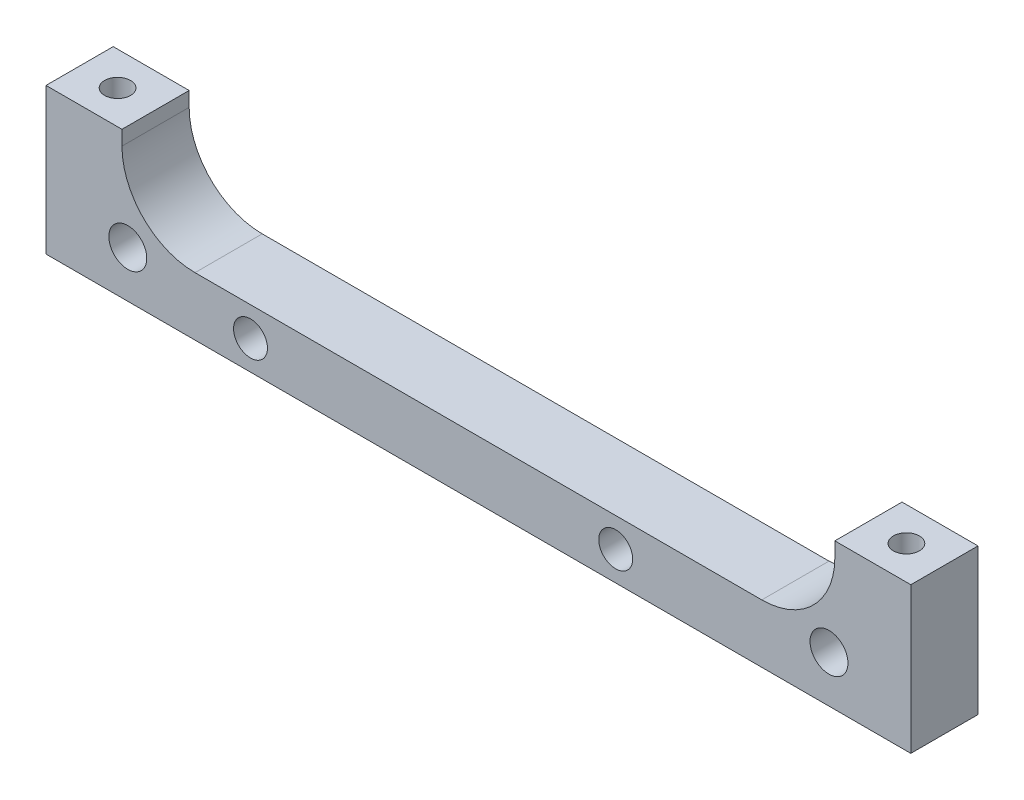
ISO-10303-21;
HEADER;
FILE_DESCRIPTION(('STEP AP214'),'2;1');
FILE_NAME('part.step','',(''),(''),'','','');
FILE_SCHEMA(('AUTOMOTIVE_DESIGN { 1 0 10303 214 1 1 1 1 }'));
ENDSEC;
DATA;
#1=APPLICATION_CONTEXT('core data for automotive mechanical design processes');
#2=APPLICATION_PROTOCOL_DEFINITION('international standard','automotive_design',2000,#1);
#3=PRODUCT_CONTEXT('',#1,'mechanical');
#4=PRODUCT('Part','Part','',(#3));
#5=PRODUCT_RELATED_PRODUCT_CATEGORY('part','',(#4));
#6=PRODUCT_DEFINITION_FORMATION('','',#4);
#7=PRODUCT_DEFINITION_CONTEXT('part definition',#1,'design');
#8=PRODUCT_DEFINITION('design','',#6,#7);
#9=PRODUCT_DEFINITION_SHAPE('','',#8);
#10=(LENGTH_UNIT() NAMED_UNIT(*) SI_UNIT(.MILLI.,.METRE.));
#11=(NAMED_UNIT(*) PLANE_ANGLE_UNIT() SI_UNIT($,.RADIAN.));
#12=(NAMED_UNIT(*) SI_UNIT($,.STERADIAN.) SOLID_ANGLE_UNIT());
#13=UNCERTAINTY_MEASURE_WITH_UNIT(LENGTH_MEASURE(1.E-05),#10,'distance_accuracy_value','');
#14=(GEOMETRIC_REPRESENTATION_CONTEXT(3) GLOBAL_UNCERTAINTY_ASSIGNED_CONTEXT((#13)) GLOBAL_UNIT_ASSIGNED_CONTEXT((#10,
#11,#12)) REPRESENTATION_CONTEXT('',''));
#15=CARTESIAN_POINT('',(0.,0.,0.));
#16=DIRECTION('',(0.,0.,1.));
#17=DIRECTION('',(1.,0.,0.));
#18=AXIS2_PLACEMENT_3D('',#15,#16,#17);
#19=CARTESIAN_POINT('',(0.,0.,5.842));
#20=DIRECTION('',(0.,-1.,0.));
#21=DIRECTION('',(0.,0.,-1.));
#22=AXIS2_PLACEMENT_3D('',#19,#20,#21);
#23=PLANE('',#22);
#24=CARTESIAN_POINT('',(3.302,0.,2.921));
#25=DIRECTION('',(0.,1.,0.));
#26=DIRECTION('',(0.,0.,1.));
#27=AXIS2_PLACEMENT_3D('',#24,#25,#26);
#28=CIRCLE('',#27,1.13029999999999);
#29=CARTESIAN_POINT('',(3.302,0.,4.05129999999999));
#30=VERTEX_POINT('',#29);
#31=EDGE_CURVE('E122',#30,#30,#28,.T.);
#32=ORIENTED_EDGE('',*,*,#31,.F.);
#33=EDGE_LOOP('',(#32));
#34=FACE_BOUND('',#33,.T.);
#35=DIRECTION('',(-1.,0.,0.));
#36=VECTOR('',#35,1.);
#37=CARTESIAN_POINT('',(0.,0.,5.842));
#38=LINE('',#37,#36);
#39=CARTESIAN_POINT('',(6.604,0.,5.842));
#40=VERTEX_POINT('',#39);
#41=CARTESIAN_POINT('',(0.,0.,5.842));
#42=VERTEX_POINT('',#41);
#43=EDGE_CURVE('E167',#40,#42,#38,.T.);
#44=ORIENTED_EDGE('',*,*,#43,.F.);
#45=DIRECTION('',(0.,0.,1.));
#46=VECTOR('',#45,1.);
#47=CARTESIAN_POINT('',(6.604,0.,0.));
#48=LINE('',#47,#46);
#49=CARTESIAN_POINT('',(6.604,0.,0.));
#50=VERTEX_POINT('',#49);
#51=EDGE_CURVE('E154',#50,#40,#48,.T.);
#52=ORIENTED_EDGE('',*,*,#51,.F.);
#53=DIRECTION('',(-1.,0.,0.));
#54=VECTOR('',#53,1.);
#55=CARTESIAN_POINT('',(0.,0.,0.));
#56=LINE('',#55,#54);
#57=CARTESIAN_POINT('',(0.,0.,0.));
#58=VERTEX_POINT('',#57);
#59=EDGE_CURVE('E178',#50,#58,#56,.T.);
#60=ORIENTED_EDGE('',*,*,#59,.T.);
#61=DIRECTION('',(0.,0.,-1.));
#62=VECTOR('',#61,1.);
#63=CARTESIAN_POINT('',(0.,0.,5.842));
#64=LINE('',#63,#62);
#65=EDGE_CURVE('E171',#42,#58,#64,.T.);
#66=ORIENTED_EDGE('',*,*,#65,.F.);
#67=EDGE_LOOP('',(#44,#52,#60,#66));
#68=FACE_BOUND('',#67,.T.);
#69=ADVANCED_FACE('F32',(#34,#68),#23,.F.);
#70=CARTESIAN_POINT('',(0.,0.,5.842));
#71=DIRECTION('',(1.,0.,0.));
#72=DIRECTION('',(0.,1.,0.));
#73=AXIS2_PLACEMENT_3D('',#70,#71,#72);
#74=PLANE('',#73);
#75=DIRECTION('',(0.,-1.,0.));
#76=VECTOR('',#75,1.);
#77=CARTESIAN_POINT('',(0.,0.,0.));
#78=LINE('',#77,#76);
#79=CARTESIAN_POINT('',(0.,-12.7,0.));
#80=VERTEX_POINT('',#79);
#81=EDGE_CURVE('E156',#58,#80,#78,.T.);
#82=ORIENTED_EDGE('',*,*,#81,.T.);
#83=DIRECTION('',(0.,0.,-1.));
#84=VECTOR('',#83,1.);
#85=CARTESIAN_POINT('',(0.,-12.7,5.842));
#86=LINE('',#85,#84);
#87=CARTESIAN_POINT('',(0.,-12.7,5.842));
#88=VERTEX_POINT('',#87);
#89=EDGE_CURVE('E189',#88,#80,#86,.T.);
#90=ORIENTED_EDGE('',*,*,#89,.F.);
#91=DIRECTION('',(0.,-1.,0.));
#92=VECTOR('',#91,1.);
#93=CARTESIAN_POINT('',(0.,0.,5.842));
#94=LINE('',#93,#92);
#95=EDGE_CURVE('E159',#42,#88,#94,.T.);
#96=ORIENTED_EDGE('',*,*,#95,.F.);
#97=ORIENTED_EDGE('',*,*,#65,.T.);
#98=EDGE_LOOP('',(#82,#90,#96,#97));
#99=FACE_BOUND('',#98,.T.);
#100=ADVANCED_FACE('F233',(#99),#74,.F.);
#101=CARTESIAN_POINT('',(0.,-12.7,5.842));
#102=DIRECTION('',(0.,1.,0.));
#103=DIRECTION('',(0.,0.,1.));
#104=AXIS2_PLACEMENT_3D('',#101,#102,#103);
#105=PLANE('',#104);
#106=DIRECTION('',(1.,0.,0.));
#107=VECTOR('',#106,1.);
#108=CARTESIAN_POINT('',(0.,-12.7,0.));
#109=LINE('',#108,#107);
#110=CARTESIAN_POINT('',(75.184,-12.7,0.));
#111=VERTEX_POINT('',#110);
#112=EDGE_CURVE('E174',#80,#111,#109,.T.);
#113=ORIENTED_EDGE('',*,*,#112,.T.);
#114=DIRECTION('',(0.,0.,-1.));
#115=VECTOR('',#114,1.);
#116=CARTESIAN_POINT('',(75.184,-12.7,5.842));
#117=LINE('',#116,#115);
#118=CARTESIAN_POINT('',(75.184,-12.7,5.842));
#119=VERTEX_POINT('',#118);
#120=EDGE_CURVE('E186',#119,#111,#117,.T.);
#121=ORIENTED_EDGE('',*,*,#120,.F.);
#122=DIRECTION('',(1.,0.,0.));
#123=VECTOR('',#122,1.);
#124=CARTESIAN_POINT('',(0.,-12.7,5.842));
#125=LINE('',#124,#123);
#126=EDGE_CURVE('E162',#88,#119,#125,.T.);
#127=ORIENTED_EDGE('',*,*,#126,.F.);
#128=ORIENTED_EDGE('',*,*,#89,.T.);
#129=EDGE_LOOP('',(#113,#121,#127,#128));
#130=FACE_BOUND('',#129,.T.);
#131=ADVANCED_FACE('F229',(#130),#105,.F.);
#132=CARTESIAN_POINT('',(75.184,0.,5.842));
#133=DIRECTION('',(-1.,0.,0.));
#134=DIRECTION('',(0.,0.,1.));
#135=AXIS2_PLACEMENT_3D('',#132,#133,#134);
#136=PLANE('',#135);
#137=DIRECTION('',(0.,1.,0.));
#138=VECTOR('',#137,1.);
#139=CARTESIAN_POINT('',(75.184,0.,0.));
#140=LINE('',#139,#138);
#141=CARTESIAN_POINT('',(75.184,0.,0.));
#142=VERTEX_POINT('',#141);
#143=EDGE_CURVE('E176',#111,#142,#140,.T.);
#144=ORIENTED_EDGE('',*,*,#143,.T.);
#145=DIRECTION('',(0.,0.,-1.));
#146=VECTOR('',#145,1.);
#147=CARTESIAN_POINT('',(75.184,0.,5.842));
#148=LINE('',#147,#146);
#149=CARTESIAN_POINT('',(75.184,0.,5.842));
#150=VERTEX_POINT('',#149);
#151=EDGE_CURVE('E183',#150,#142,#148,.T.);
#152=ORIENTED_EDGE('',*,*,#151,.F.);
#153=DIRECTION('',(0.,1.,0.));
#154=VECTOR('',#153,1.);
#155=CARTESIAN_POINT('',(75.184,0.,5.842));
#156=LINE('',#155,#154);
#157=EDGE_CURVE('E165',#119,#150,#156,.T.);
#158=ORIENTED_EDGE('',*,*,#157,.F.);
#159=ORIENTED_EDGE('',*,*,#120,.T.);
#160=EDGE_LOOP('',(#144,#152,#158,#159));
#161=FACE_BOUND('',#160,.T.);
#162=ADVANCED_FACE('F226',(#161),#136,.F.);
#163=CARTESIAN_POINT('',(71.882,0.,2.921));
#164=DIRECTION('',(0.,1.,0.));
#165=DIRECTION('',(0.,0.,1.));
#166=AXIS2_PLACEMENT_3D('',#163,#164,#165);
#167=CIRCLE('',#166,1.13029999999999);
#168=CARTESIAN_POINT('',(71.882,0.,4.05129999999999));
#169=VERTEX_POINT('',#168);
#170=EDGE_CURVE('E135',#169,#169,#167,.T.);
#171=ORIENTED_EDGE('',*,*,#170,.F.);
#172=EDGE_LOOP('',(#171));
#173=FACE_BOUND('',#172,.T.);
#174=CARTESIAN_POINT('',(68.58,0.,0.));
#175=VERTEX_POINT('',#174);
#176=EDGE_CURVE('E163',#142,#175,#56,.T.);
#177=ORIENTED_EDGE('',*,*,#176,.T.);
#178=DIRECTION('',(0.,0.,1.));
#179=VECTOR('',#178,1.);
#180=CARTESIAN_POINT('',(68.58,0.,0.));
#181=LINE('',#180,#179);
#182=CARTESIAN_POINT('',(68.58,0.,5.842));
#183=VERTEX_POINT('',#182);
#184=EDGE_CURVE('E147',#175,#183,#181,.T.);
#185=ORIENTED_EDGE('',*,*,#184,.T.);
#186=EDGE_CURVE('E168',#150,#183,#38,.T.);
#187=ORIENTED_EDGE('',*,*,#186,.F.);
#188=ORIENTED_EDGE('',*,*,#151,.T.);
#189=EDGE_LOOP('',(#177,#185,#187,#188));
#190=FACE_BOUND('',#189,.T.);
#191=ADVANCED_FACE('F221',(#173,#190),#23,.F.);
#192=CARTESIAN_POINT('',(0.,-12.7,5.842));
#193=DIRECTION('',(0.,0.,1.));
#194=DIRECTION('',(1.,0.,0.));
#195=AXIS2_PLACEMENT_3D('',#192,#193,#194);
#196=PLANE('',#195);
#197=CARTESIAN_POINT('',(68.072,-8.64394526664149,5.842));
#198=DIRECTION('',(0.,0.,-1.));
#199=DIRECTION('',(-1.,0.,0.));
#200=AXIS2_PLACEMENT_3D('',#197,#198,#199);
#201=CIRCLE('',#200,1.65);
#202=CARTESIAN_POINT('',(66.422,-8.64394526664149,5.842));
#203=VERTEX_POINT('',#202);
#204=EDGE_CURVE('E374',#203,#203,#201,.T.);
#205=ORIENTED_EDGE('',*,*,#204,.T.);
#206=EDGE_LOOP('',(#205));
#207=FACE_BOUND('',#206,.T.);
#208=CARTESIAN_POINT('',(7.112,-8.64394526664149,5.842));
#209=DIRECTION('',(0.,0.,-1.));
#210=DIRECTION('',(-1.,0.,0.));
#211=AXIS2_PLACEMENT_3D('',#208,#209,#210);
#212=CIRCLE('',#211,1.65);
#213=CARTESIAN_POINT('',(5.462,-8.64394526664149,5.842));
#214=VERTEX_POINT('',#213);
#215=EDGE_CURVE('E375',#214,#214,#212,.T.);
#216=ORIENTED_EDGE('',*,*,#215,.T.);
#217=EDGE_LOOP('',(#216));
#218=FACE_BOUND('',#217,.T.);
#219=CARTESIAN_POINT('',(49.53,-10.16,5.842));
#220=DIRECTION('',(0.,0.,-1.));
#221=DIRECTION('',(-1.,0.,0.));
#222=AXIS2_PLACEMENT_3D('',#219,#220,#221);
#223=CIRCLE('',#222,1.4732);
#224=CARTESIAN_POINT('',(48.0568,-10.16,5.842));
#225=VERTEX_POINT('',#224);
#226=EDGE_CURVE('E382',#225,#225,#223,.T.);
#227=ORIENTED_EDGE('',*,*,#226,.T.);
#228=EDGE_LOOP('',(#227));
#229=FACE_BOUND('',#228,.T.);
#230=CARTESIAN_POINT('',(17.78,-10.16,5.842));
#231=DIRECTION('',(0.,0.,-1.));
#232=DIRECTION('',(-1.,0.,0.));
#233=AXIS2_PLACEMENT_3D('',#230,#231,#232);
#234=CIRCLE('',#233,1.4732);
#235=CARTESIAN_POINT('',(16.3068,-10.16,5.842));
#236=VERTEX_POINT('',#235);
#237=EDGE_CURVE('E129',#236,#236,#234,.T.);
#238=ORIENTED_EDGE('',*,*,#237,.T.);
#239=EDGE_LOOP('',(#238));
#240=FACE_BOUND('',#239,.T.);
#241=DIRECTION('',(0.,-1.,0.));
#242=VECTOR('',#241,1.);
#243=CARTESIAN_POINT('',(6.604,0.,5.842));
#244=LINE('',#243,#242);
#245=CARTESIAN_POINT('',(6.604,-1.27,5.842));
#246=VERTEX_POINT('',#245);
#247=EDGE_CURVE('E138',#40,#246,#244,.T.);
#248=ORIENTED_EDGE('',*,*,#247,.F.);
#249=ORIENTED_EDGE('',*,*,#43,.T.);
#250=ORIENTED_EDGE('',*,*,#95,.T.);
#251=ORIENTED_EDGE('',*,*,#126,.T.);
#252=ORIENTED_EDGE('',*,*,#157,.T.);
#253=ORIENTED_EDGE('',*,*,#186,.T.);
#254=DIRECTION('',(0.,1.,0.));
#255=VECTOR('',#254,1.);
#256=CARTESIAN_POINT('',(68.58,0.,5.842));
#257=LINE('',#256,#255);
#258=CARTESIAN_POINT('',(68.58,-1.27,5.842));
#259=VERTEX_POINT('',#258);
#260=EDGE_CURVE('E143',#259,#183,#257,.T.);
#261=ORIENTED_EDGE('',*,*,#260,.F.);
#262=CARTESIAN_POINT('',(62.23,-1.27,5.842));
#263=DIRECTION('',(0.,0.,1.));
#264=DIRECTION('',(1.,0.,0.));
#265=AXIS2_PLACEMENT_3D('',#262,#263,#264);
#266=CIRCLE('',#265,6.35);
#267=CARTESIAN_POINT('',(62.23,-7.62,5.842));
#268=VERTEX_POINT('',#267);
#269=EDGE_CURVE('E40',#259,#268,#266,.F.);
#270=ORIENTED_EDGE('',*,*,#269,.T.);
#271=DIRECTION('',(1.,0.,0.));
#272=VECTOR('',#271,1.);
#273=CARTESIAN_POINT('',(6.604,-7.62,5.842));
#274=LINE('',#273,#272);
#275=CARTESIAN_POINT('',(12.954,-7.62,5.842));
#276=VERTEX_POINT('',#275);
#277=EDGE_CURVE('E150',#276,#268,#274,.T.);
#278=ORIENTED_EDGE('',*,*,#277,.F.);
#279=CARTESIAN_POINT('',(12.954,-1.27,5.842));
#280=DIRECTION('',(0.,0.,1.));
#281=DIRECTION('',(1.,0.,0.));
#282=AXIS2_PLACEMENT_3D('',#279,#280,#281);
#283=CIRCLE('',#282,6.35);
#284=EDGE_CURVE('E201',#276,#246,#283,.F.);
#285=ORIENTED_EDGE('',*,*,#284,.T.);
#286=EDGE_LOOP('',(#248,#249,#250,#251,#252,#253,#261,#270,#278,#285));
#287=FACE_BOUND('',#286,.T.);
#288=ADVANCED_FACE('F208',(#207,#218,#229,#240,#287),#196,.T.);
#289=CARTESIAN_POINT('',(0.,-12.7,0.));
#290=DIRECTION('',(0.,0.,1.));
#291=DIRECTION('',(1.,0.,0.));
#292=AXIS2_PLACEMENT_3D('',#289,#290,#291);
#293=PLANE('',#292);
#294=CARTESIAN_POINT('',(68.072,-8.64394526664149,0.));
#295=DIRECTION('',(0.,0.,-1.));
#296=DIRECTION('',(-1.,0.,0.));
#297=AXIS2_PLACEMENT_3D('',#294,#295,#296);
#298=CIRCLE('',#297,1.64999999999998);
#299=CARTESIAN_POINT('',(66.422,-8.64394526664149,0.));
#300=VERTEX_POINT('',#299);
#301=EDGE_CURVE('E294',#300,#300,#298,.T.);
#302=ORIENTED_EDGE('',*,*,#301,.F.);
#303=EDGE_LOOP('',(#302));
#304=FACE_BOUND('',#303,.T.);
#305=CARTESIAN_POINT('',(7.112,-8.64394526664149,0.));
#306=DIRECTION('',(0.,0.,-1.));
#307=DIRECTION('',(-1.,0.,0.));
#308=AXIS2_PLACEMENT_3D('',#305,#306,#307);
#309=CIRCLE('',#308,1.64999999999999);
#310=CARTESIAN_POINT('',(5.46200000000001,-8.64394526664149,0.));
#311=VERTEX_POINT('',#310);
#312=EDGE_CURVE('E298',#311,#311,#309,.T.);
#313=ORIENTED_EDGE('',*,*,#312,.F.);
#314=EDGE_LOOP('',(#313));
#315=FACE_BOUND('',#314,.T.);
#316=CARTESIAN_POINT('',(49.53,-10.16,0.));
#317=DIRECTION('',(0.,0.,-1.));
#318=DIRECTION('',(-1.,0.,0.));
#319=AXIS2_PLACEMENT_3D('',#316,#317,#318);
#320=CIRCLE('',#319,1.47319999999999);
#321=CARTESIAN_POINT('',(48.0568,-10.16,0.));
#322=VERTEX_POINT('',#321);
#323=EDGE_CURVE('E302',#322,#322,#320,.T.);
#324=ORIENTED_EDGE('',*,*,#323,.F.);
#325=EDGE_LOOP('',(#324));
#326=FACE_BOUND('',#325,.T.);
#327=CARTESIAN_POINT('',(17.78,-10.16,0.));
#328=DIRECTION('',(0.,0.,-1.));
#329=DIRECTION('',(-1.,0.,0.));
#330=AXIS2_PLACEMENT_3D('',#327,#328,#329);
#331=CIRCLE('',#330,1.47319999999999);
#332=CARTESIAN_POINT('',(16.3068,-10.16,0.));
#333=VERTEX_POINT('',#332);
#334=EDGE_CURVE('E123',#333,#333,#331,.T.);
#335=ORIENTED_EDGE('',*,*,#334,.F.);
#336=EDGE_LOOP('',(#335));
#337=FACE_BOUND('',#336,.T.);
#338=ORIENTED_EDGE('',*,*,#59,.F.);
#339=DIRECTION('',(0.,-1.,0.));
#340=VECTOR('',#339,1.);
#341=CARTESIAN_POINT('',(6.604,0.,0.));
#342=LINE('',#341,#340);
#343=CARTESIAN_POINT('',(6.604,-1.27,0.));
#344=VERTEX_POINT('',#343);
#345=EDGE_CURVE('E139',#50,#344,#342,.T.);
#346=ORIENTED_EDGE('',*,*,#345,.T.);
#347=CARTESIAN_POINT('',(12.954,-1.27,0.));
#348=DIRECTION('',(0.,0.,1.));
#349=DIRECTION('',(1.,0.,0.));
#350=AXIS2_PLACEMENT_3D('',#347,#348,#349);
#351=CIRCLE('',#350,6.35);
#352=CARTESIAN_POINT('',(12.954,-7.62,0.));
#353=VERTEX_POINT('',#352);
#354=EDGE_CURVE('E203',#344,#353,#351,.T.);
#355=ORIENTED_EDGE('',*,*,#354,.T.);
#356=DIRECTION('',(1.,0.,0.));
#357=VECTOR('',#356,1.);
#358=CARTESIAN_POINT('',(6.604,-7.62,0.));
#359=LINE('',#358,#357);
#360=CARTESIAN_POINT('',(62.23,-7.62,0.));
#361=VERTEX_POINT('',#360);
#362=EDGE_CURVE('E142',#353,#361,#359,.T.);
#363=ORIENTED_EDGE('',*,*,#362,.T.);
#364=CARTESIAN_POINT('',(62.23,-1.27,0.));
#365=DIRECTION('',(0.,0.,1.));
#366=DIRECTION('',(1.,0.,0.));
#367=AXIS2_PLACEMENT_3D('',#364,#365,#366);
#368=CIRCLE('',#367,6.35);
#369=CARTESIAN_POINT('',(68.58,-1.27,0.));
#370=VERTEX_POINT('',#369);
#371=EDGE_CURVE('E11',#361,#370,#368,.T.);
#372=ORIENTED_EDGE('',*,*,#371,.T.);
#373=DIRECTION('',(0.,1.,0.));
#374=VECTOR('',#373,1.);
#375=CARTESIAN_POINT('',(68.58,0.,0.));
#376=LINE('',#375,#374);
#377=EDGE_CURVE('E145',#370,#175,#376,.T.);
#378=ORIENTED_EDGE('',*,*,#377,.T.);
#379=ORIENTED_EDGE('',*,*,#176,.F.);
#380=ORIENTED_EDGE('',*,*,#143,.F.);
#381=ORIENTED_EDGE('',*,*,#112,.F.);
#382=ORIENTED_EDGE('',*,*,#81,.F.);
#383=EDGE_LOOP('',(#338,#346,#355,#363,#372,#378,#379,#380,#381,#382));
#384=FACE_BOUND('',#383,.T.);
#385=ADVANCED_FACE('F218',(#304,#315,#326,#337,#384),#293,.F.);
#386=CARTESIAN_POINT('',(6.604,0.,0.));
#387=DIRECTION('',(-1.,0.,0.));
#388=DIRECTION('',(0.,-1.,0.));
#389=AXIS2_PLACEMENT_3D('',#386,#387,#388);
#390=PLANE('',#389);
#391=ORIENTED_EDGE('',*,*,#247,.T.);
#392=DIRECTION('',(0.,0.,1.));
#393=VECTOR('',#392,1.);
#394=CARTESIAN_POINT('',(6.604,-1.27,0.));
#395=LINE('',#394,#393);
#396=EDGE_CURVE('E197',#246,#344,#395,.F.);
#397=ORIENTED_EDGE('',*,*,#396,.T.);
#398=ORIENTED_EDGE('',*,*,#345,.F.);
#399=ORIENTED_EDGE('',*,*,#51,.T.);
#400=EDGE_LOOP('',(#391,#397,#398,#399));
#401=FACE_BOUND('',#400,.T.);
#402=ADVANCED_FACE('F240',(#401),#390,.F.);
#403=CARTESIAN_POINT('',(68.58,0.,0.));
#404=DIRECTION('',(1.,0.,0.));
#405=DIRECTION('',(0.,0.,-1.));
#406=AXIS2_PLACEMENT_3D('',#403,#404,#405);
#407=PLANE('',#406);
#408=ORIENTED_EDGE('',*,*,#377,.F.);
#409=DIRECTION('',(0.,0.,1.));
#410=VECTOR('',#409,1.);
#411=CARTESIAN_POINT('',(68.58,-1.27,5.842));
#412=LINE('',#411,#410);
#413=EDGE_CURVE('E199',#370,#259,#412,.T.);
#414=ORIENTED_EDGE('',*,*,#413,.T.);
#415=ORIENTED_EDGE('',*,*,#260,.T.);
#416=ORIENTED_EDGE('',*,*,#184,.F.);
#417=EDGE_LOOP('',(#408,#414,#415,#416));
#418=FACE_BOUND('',#417,.T.);
#419=ADVANCED_FACE('F214',(#418),#407,.F.);
#420=CARTESIAN_POINT('',(6.604,-7.62,0.));
#421=DIRECTION('',(0.,-1.,0.));
#422=DIRECTION('',(0.,0.,-1.));
#423=AXIS2_PLACEMENT_3D('',#420,#421,#422);
#424=PLANE('',#423);
#425=ORIENTED_EDGE('',*,*,#362,.F.);
#426=DIRECTION('',(0.,0.,1.));
#427=VECTOR('',#426,1.);
#428=CARTESIAN_POINT('',(12.954,-7.62,5.842));
#429=LINE('',#428,#427);
#430=EDGE_CURVE('E194',#353,#276,#429,.T.);
#431=ORIENTED_EDGE('',*,*,#430,.T.);
#432=ORIENTED_EDGE('',*,*,#277,.T.);
#433=DIRECTION('',(0.,0.,1.));
#434=VECTOR('',#433,1.);
#435=CARTESIAN_POINT('',(62.23,-7.62,0.));
#436=LINE('',#435,#434);
#437=EDGE_CURVE('E192',#268,#361,#436,.F.);
#438=ORIENTED_EDGE('',*,*,#437,.T.);
#439=EDGE_LOOP('',(#425,#431,#432,#438));
#440=FACE_BOUND('',#439,.T.);
#441=ADVANCED_FACE('F211',(#440),#424,.F.);
#442=CARTESIAN_POINT('',(12.954,-1.27,0.));
#443=DIRECTION('',(0.,0.,-1.));
#444=DIRECTION('',(-1.,0.,0.));
#445=AXIS2_PLACEMENT_3D('',#442,#443,#444);
#446=CYLINDRICAL_SURFACE('',#445,6.35);
#447=ORIENTED_EDGE('',*,*,#354,.F.);
#448=ORIENTED_EDGE('',*,*,#396,.F.);
#449=ORIENTED_EDGE('',*,*,#284,.F.);
#450=ORIENTED_EDGE('',*,*,#430,.F.);
#451=EDGE_LOOP('',(#447,#448,#449,#450));
#452=FACE_BOUND('',#451,.T.);
#453=ADVANCED_FACE('F244',(#452),#446,.F.);
#454=CARTESIAN_POINT('',(62.23,-1.27,0.));
#455=DIRECTION('',(0.,0.,-1.));
#456=DIRECTION('',(-1.,0.,0.));
#457=AXIS2_PLACEMENT_3D('',#454,#455,#456);
#458=CYLINDRICAL_SURFACE('',#457,6.35);
#459=ORIENTED_EDGE('',*,*,#371,.F.);
#460=ORIENTED_EDGE('',*,*,#437,.F.);
#461=ORIENTED_EDGE('',*,*,#269,.F.);
#462=ORIENTED_EDGE('',*,*,#413,.F.);
#463=EDGE_LOOP('',(#459,#460,#461,#462));
#464=FACE_BOUND('',#463,.T.);
#465=ADVANCED_FACE('F34',(#464),#458,.F.);
#466=CARTESIAN_POINT('',(71.882,0.,2.921));
#467=DIRECTION('',(0.,1.,0.));
#468=DIRECTION('',(0.,0.,1.));
#469=AXIS2_PLACEMENT_3D('',#466,#467,#468);
#470=CYLINDRICAL_SURFACE('',#469,1.13029999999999);
#471=CARTESIAN_POINT('',(71.882,-8.509,2.921));
#472=DIRECTION('',(0.,1.,0.));
#473=DIRECTION('',(0.,0.,1.));
#474=AXIS2_PLACEMENT_3D('',#471,#472,#473);
#475=CIRCLE('',#474,1.1303);
#476=CARTESIAN_POINT('',(71.882,-8.509,4.0513));
#477=VERTEX_POINT('',#476);
#478=EDGE_CURVE('E126',#477,#477,#475,.T.);
#479=ORIENTED_EDGE('',*,*,#478,.F.);
#480=EDGE_LOOP('',(#479));
#481=FACE_BOUND('',#480,.T.);
#482=ORIENTED_EDGE('',*,*,#170,.T.);
#483=EDGE_LOOP('',(#482));
#484=FACE_BOUND('',#483,.T.);
#485=ADVANCED_FACE('F250',(#481,#484),#470,.F.);
#486=CARTESIAN_POINT('',(71.882,-8.509,2.921));
#487=DIRECTION('',(0.,1.,0.));
#488=DIRECTION('',(0.,0.,1.));
#489=AXIS2_PLACEMENT_3D('',#486,#487,#488);
#490=CONICAL_SURFACE('',#489,1.1303,1.02974425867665);
#491=CARTESIAN_POINT('',(71.882,-9.18815275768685,2.921));
#492=VERTEX_POINT('',#491);
#493=VERTEX_LOOP('',#492);
#494=FACE_BOUND('',#493,.T.);
#495=ORIENTED_EDGE('',*,*,#478,.T.);
#496=EDGE_LOOP('',(#495));
#497=FACE_BOUND('',#496,.T.);
#498=ADVANCED_FACE('F273',(#494,#497),#490,.F.);
#499=CARTESIAN_POINT('',(3.302,0.,2.921));
#500=DIRECTION('',(0.,1.,0.));
#501=DIRECTION('',(0.,0.,1.));
#502=AXIS2_PLACEMENT_3D('',#499,#500,#501);
#503=CYLINDRICAL_SURFACE('',#502,1.13029999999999);
#504=CARTESIAN_POINT('',(3.302,-8.509,2.921));
#505=DIRECTION('',(0.,1.,0.));
#506=DIRECTION('',(0.,0.,1.));
#507=AXIS2_PLACEMENT_3D('',#504,#505,#506);
#508=CIRCLE('',#507,1.1303);
#509=CARTESIAN_POINT('',(3.302,-8.509,4.0513));
#510=VERTEX_POINT('',#509);
#511=EDGE_CURVE('E120',#510,#510,#508,.T.);
#512=ORIENTED_EDGE('',*,*,#511,.F.);
#513=EDGE_LOOP('',(#512));
#514=FACE_BOUND('',#513,.T.);
#515=ORIENTED_EDGE('',*,*,#31,.T.);
#516=EDGE_LOOP('',(#515));
#517=FACE_BOUND('',#516,.T.);
#518=ADVANCED_FACE('F116',(#514,#517),#503,.F.);
#519=CARTESIAN_POINT('',(3.302,-8.509,2.921));
#520=DIRECTION('',(0.,1.,0.));
#521=DIRECTION('',(0.,0.,1.));
#522=AXIS2_PLACEMENT_3D('',#519,#520,#521);
#523=CONICAL_SURFACE('',#522,1.1303,1.02974425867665);
#524=CARTESIAN_POINT('',(3.302,-9.18815275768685,2.921));
#525=VERTEX_POINT('',#524);
#526=VERTEX_LOOP('',#525);
#527=FACE_BOUND('',#526,.T.);
#528=ORIENTED_EDGE('',*,*,#511,.T.);
#529=EDGE_LOOP('',(#528));
#530=FACE_BOUND('',#529,.T.);
#531=ADVANCED_FACE('F112',(#527,#530),#523,.F.);
#532=CARTESIAN_POINT('',(17.78,-10.16,0.));
#533=DIRECTION('',(0.,0.,-1.));
#534=DIRECTION('',(-1.,0.,0.));
#535=AXIS2_PLACEMENT_3D('',#532,#533,#534);
#536=CYLINDRICAL_SURFACE('',#535,1.47319999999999);
#537=ORIENTED_EDGE('',*,*,#237,.F.);
#538=EDGE_LOOP('',(#537));
#539=FACE_BOUND('',#538,.T.);
#540=ORIENTED_EDGE('',*,*,#334,.T.);
#541=EDGE_LOOP('',(#540));
#542=FACE_BOUND('',#541,.T.);
#543=ADVANCED_FACE('F115',(#539,#542),#536,.F.);
#544=CARTESIAN_POINT('',(49.53,-10.16,0.));
#545=DIRECTION('',(0.,0.,-1.));
#546=DIRECTION('',(-1.,0.,0.));
#547=AXIS2_PLACEMENT_3D('',#544,#545,#546);
#548=CYLINDRICAL_SURFACE('',#547,1.47319999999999);
#549=ORIENTED_EDGE('',*,*,#226,.F.);
#550=EDGE_LOOP('',(#549));
#551=FACE_BOUND('',#550,.T.);
#552=ORIENTED_EDGE('',*,*,#323,.T.);
#553=EDGE_LOOP('',(#552));
#554=FACE_BOUND('',#553,.T.);
#555=ADVANCED_FACE('F306',(#551,#554),#548,.F.);
#556=CARTESIAN_POINT('',(7.112,-8.64394526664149,0.));
#557=DIRECTION('',(0.,0.,-1.));
#558=DIRECTION('',(-1.,0.,0.));
#559=AXIS2_PLACEMENT_3D('',#556,#557,#558);
#560=CYLINDRICAL_SURFACE('',#559,1.64999999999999);
#561=ORIENTED_EDGE('',*,*,#215,.F.);
#562=EDGE_LOOP('',(#561));
#563=FACE_BOUND('',#562,.T.);
#564=ORIENTED_EDGE('',*,*,#312,.T.);
#565=EDGE_LOOP('',(#564));
#566=FACE_BOUND('',#565,.T.);
#567=ADVANCED_FACE('F312',(#563,#566),#560,.F.);
#568=CARTESIAN_POINT('',(68.072,-8.64394526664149,0.));
#569=DIRECTION('',(0.,0.,-1.));
#570=DIRECTION('',(-1.,0.,0.));
#571=AXIS2_PLACEMENT_3D('',#568,#569,#570);
#572=CYLINDRICAL_SURFACE('',#571,1.64999999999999);
#573=ORIENTED_EDGE('',*,*,#204,.F.);
#574=EDGE_LOOP('',(#573));
#575=FACE_BOUND('',#574,.T.);
#576=ORIENTED_EDGE('',*,*,#301,.T.);
#577=EDGE_LOOP('',(#576));
#578=FACE_BOUND('',#577,.T.);
#579=ADVANCED_FACE('F358',(#575,#578),#572,.F.);
#580=CLOSED_SHELL('',(#69,#100,#131,#162,#191,#288,#385,#402,#419,#441,#453,#465,#485,#498,#518,
#531,#543,#555,#567,#579));
#581=MANIFOLD_SOLID_BREP('B2',#580);
#582=ADVANCED_BREP_SHAPE_REPRESENTATION('',(#18,#581),#14);
#583=SHAPE_DEFINITION_REPRESENTATION(#9,#582);
ENDSEC;
END-ISO-10303-21;
